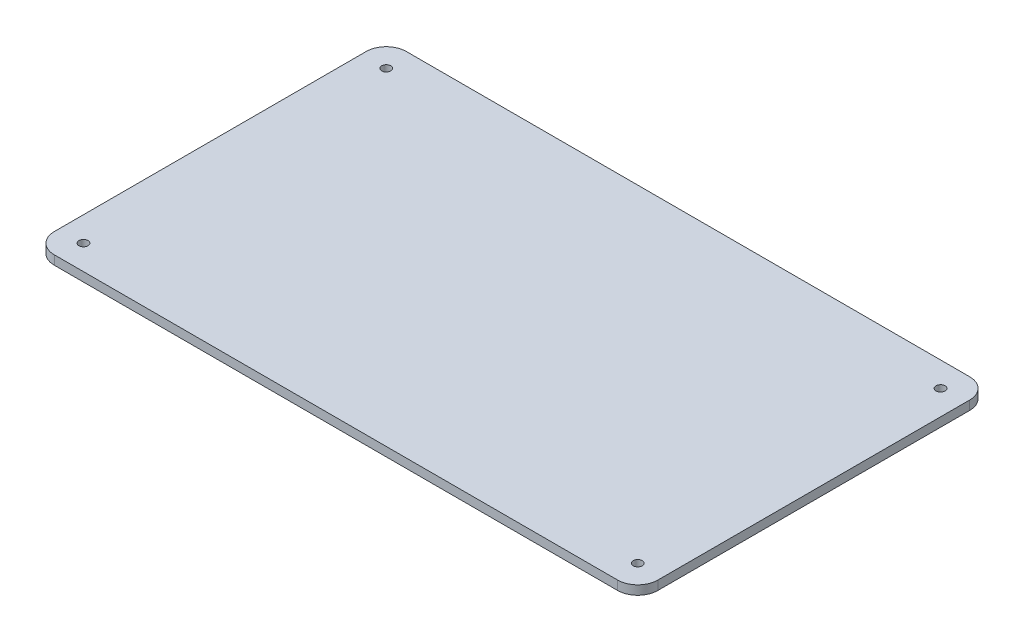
from build123d import *

# Parameters (mm, degrees)
BOSS_EXTRUDE1_DEPTH  = 4.5
M4_CLEARANCE_HOLE1_D = 4.5


with BuildPart() as part:
    # Sketch1 → Boss-Extrude1 (new body)
    with BuildSketch(Plane(origin=(0, 0, 0), x_dir=(1, 0, 0), z_dir=(0, 1, 0))):
        with BuildLine():
            Line((140, -87.5), (-140, -87.5))
            ThreePointArc((-140, -87.5), (-147.071067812, -84.571067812), (-150, -77.5))
            Line((-150, -77.5), (-150, 77.5))
            ThreePointArc((-150, 77.5), (-147.071067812, 84.571067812), (-140, 87.5))
            Line((-140, 87.5), (140, 87.5))
            ThreePointArc((140, 87.5), (147.071067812, 84.571067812), (150, 77.5))
            Line((150, 77.5), (150, -77.5))
            ThreePointArc((150, -77.5), (147.071067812, -84.571067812), (140, -87.5))
        make_face()
    extrude(amount=BOSS_EXTRUDE1_DEPTH)

    # M4 Clearance Hole1 (through all)
    with Locations(Plane(origin=(0, 4.5, 0), x_dir=(1, 0, 0), z_dir=(0, 1, 0))):
        with Locations((-137.75, 75.25), (137.75, 75.25), (137.75, -75.25), (-137.75, -75.25)):
            Hole(M4_CLEARANCE_HOLE1_D / 2)


solid = part.part
